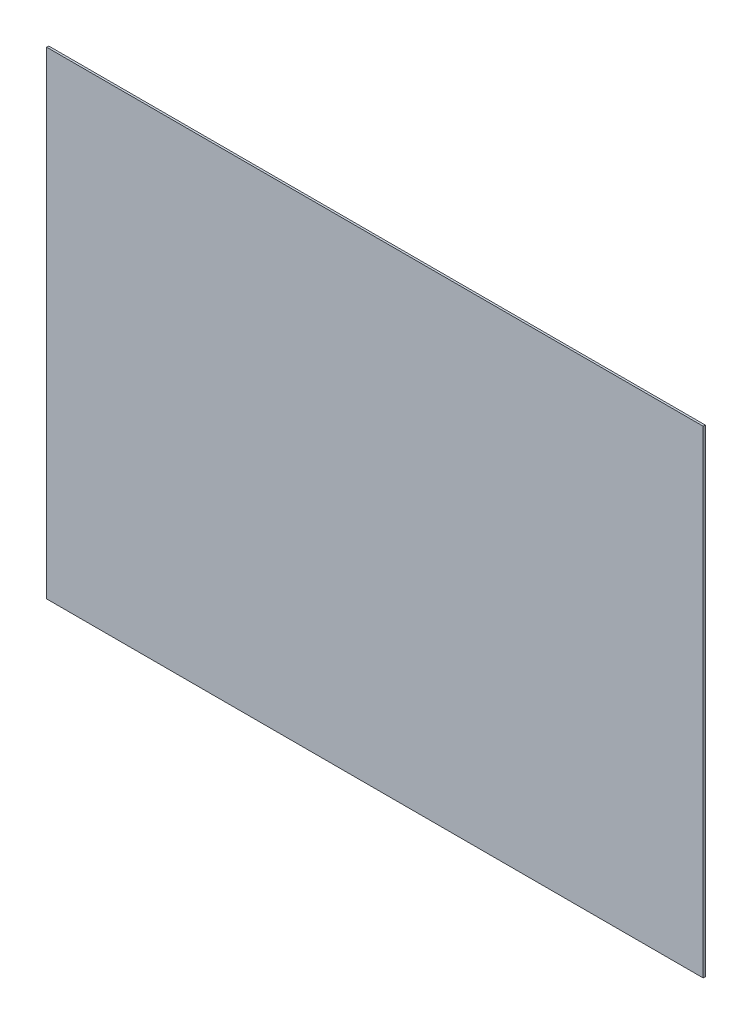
ISO-10303-21;
HEADER;
FILE_DESCRIPTION(('STEP AP214'),'2;1');
FILE_NAME('part.step','',(''),(''),'','','');
FILE_SCHEMA(('AUTOMOTIVE_DESIGN { 1 0 10303 214 1 1 1 1 }'));
ENDSEC;
DATA;
#1=APPLICATION_CONTEXT('core data for automotive mechanical design processes');
#2=APPLICATION_PROTOCOL_DEFINITION('international standard','automotive_design',2000,#1);
#3=PRODUCT_CONTEXT('',#1,'mechanical');
#4=PRODUCT('Part','Part','',(#3));
#5=PRODUCT_RELATED_PRODUCT_CATEGORY('part','',(#4));
#6=PRODUCT_DEFINITION_FORMATION('','',#4);
#7=PRODUCT_DEFINITION_CONTEXT('part definition',#1,'design');
#8=PRODUCT_DEFINITION('design','',#6,#7);
#9=PRODUCT_DEFINITION_SHAPE('','',#8);
#10=(LENGTH_UNIT() NAMED_UNIT(*) SI_UNIT(.MILLI.,.METRE.));
#11=(NAMED_UNIT(*) PLANE_ANGLE_UNIT() SI_UNIT($,.RADIAN.));
#12=(NAMED_UNIT(*) SI_UNIT($,.STERADIAN.) SOLID_ANGLE_UNIT());
#13=UNCERTAINTY_MEASURE_WITH_UNIT(LENGTH_MEASURE(1.E-05),#10,'distance_accuracy_value','');
#14=(GEOMETRIC_REPRESENTATION_CONTEXT(3) GLOBAL_UNCERTAINTY_ASSIGNED_CONTEXT((#13)) GLOBAL_UNIT_ASSIGNED_CONTEXT((#10,
#11,#12)) REPRESENTATION_CONTEXT('',''));
#15=CARTESIAN_POINT('',(0.,0.,0.));
#16=DIRECTION('',(0.,0.,1.));
#17=DIRECTION('',(1.,0.,0.));
#18=AXIS2_PLACEMENT_3D('',#15,#16,#17);
#19=CARTESIAN_POINT('',(1143.06357996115,247.149382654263,0.5));
#20=DIRECTION('',(0.,1.,0.));
#21=DIRECTION('',(0.,0.,1.));
#22=AXIS2_PLACEMENT_3D('',#19,#20,#21);
#23=PLANE('',#22);
#24=DIRECTION('',(1.,0.,0.));
#25=VECTOR('',#24,1.);
#26=CARTESIAN_POINT('',(1143.06357996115,247.149382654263,0.5));
#27=LINE('',#26,#25);
#28=CARTESIAN_POINT('',(1144.06357996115,247.149382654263,0.5));
#29=VERTEX_POINT('',#28);
#30=CARTESIAN_POINT('',(1302.0635799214,247.149382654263,0.5));
#31=VERTEX_POINT('',#30);
#32=EDGE_CURVE('E91',#29,#31,#27,.T.);
#33=ORIENTED_EDGE('',*,*,#32,.F.);
#34=DIRECTION('',(0.,0.,-1.));
#35=VECTOR('',#34,1.);
#36=CARTESIAN_POINT('',(1144.06357996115,247.149382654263,0.5));
#37=LINE('',#36,#35);
#38=CARTESIAN_POINT('',(1144.06357996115,247.149382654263,0.));
#39=VERTEX_POINT('',#38);
#40=EDGE_CURVE('E96',#29,#39,#37,.T.);
#41=ORIENTED_EDGE('',*,*,#40,.T.);
#42=DIRECTION('',(1.,0.,0.));
#43=VECTOR('',#42,1.);
#44=CARTESIAN_POINT('',(1143.06357996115,247.149382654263,0.));
#45=LINE('',#44,#43);
#46=CARTESIAN_POINT('',(1302.0635799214,247.149382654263,0.));
#47=VERTEX_POINT('',#46);
#48=EDGE_CURVE('E83',#39,#47,#45,.T.);
#49=ORIENTED_EDGE('',*,*,#48,.T.);
#50=DIRECTION('',(0.,0.,-1.));
#51=VECTOR('',#50,1.);
#52=CARTESIAN_POINT('',(1302.0635799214,247.149382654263,0.5));
#53=LINE('',#52,#51);
#54=EDGE_CURVE('E45',#31,#47,#53,.T.);
#55=ORIENTED_EDGE('',*,*,#54,.F.);
#56=EDGE_LOOP('',(#33,#41,#49,#55));
#57=FACE_BOUND('',#56,.T.);
#58=ADVANCED_FACE('F38',(#57),#23,.F.);
#59=CARTESIAN_POINT('',(1302.0635799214,247.149382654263,0.5));
#60=DIRECTION('',(-1.,0.,0.));
#61=DIRECTION('',(0.,0.,1.));
#62=AXIS2_PLACEMENT_3D('',#59,#60,#61);
#63=PLANE('',#62);
#64=DIRECTION('',(0.,1.,0.));
#65=VECTOR('',#64,1.);
#66=CARTESIAN_POINT('',(1302.0635799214,247.149382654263,0.));
#67=LINE('',#66,#65);
#68=CARTESIAN_POINT('',(1302.0635799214,362.149382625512,0.));
#69=VERTEX_POINT('',#68);
#70=EDGE_CURVE('E73',#47,#69,#67,.T.);
#71=ORIENTED_EDGE('',*,*,#70,.T.);
#72=DIRECTION('',(0.,0.,-1.));
#73=VECTOR('',#72,1.);
#74=CARTESIAN_POINT('',(1302.0635799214,362.149382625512,0.5));
#75=LINE('',#74,#73);
#76=CARTESIAN_POINT('',(1302.0635799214,362.149382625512,0.5));
#77=VERTEX_POINT('',#76);
#78=EDGE_CURVE('E76',#77,#69,#75,.T.);
#79=ORIENTED_EDGE('',*,*,#78,.F.);
#80=DIRECTION('',(0.,1.,0.));
#81=VECTOR('',#80,1.);
#82=CARTESIAN_POINT('',(1302.0635799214,247.149382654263,0.5));
#83=LINE('',#82,#81);
#84=EDGE_CURVE('E60',#31,#77,#83,.T.);
#85=ORIENTED_EDGE('',*,*,#84,.F.);
#86=ORIENTED_EDGE('',*,*,#54,.T.);
#87=EDGE_LOOP('',(#71,#79,#85,#86));
#88=FACE_BOUND('',#87,.T.);
#89=ADVANCED_FACE('F75',(#88),#63,.F.);
#90=CARTESIAN_POINT('',(1302.0635799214,362.149382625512,0.5));
#91=DIRECTION('',(0.,-1.,0.));
#92=DIRECTION('',(0.,0.,-1.));
#93=AXIS2_PLACEMENT_3D('',#90,#91,#92);
#94=PLANE('',#93);
#95=DIRECTION('',(-1.,0.,0.));
#96=VECTOR('',#95,1.);
#97=CARTESIAN_POINT('',(1302.0635799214,362.149382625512,0.));
#98=LINE('',#97,#96);
#99=CARTESIAN_POINT('',(1144.06357996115,362.149382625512,0.));
#100=VERTEX_POINT('',#99);
#101=EDGE_CURVE('E82',#69,#100,#98,.T.);
#102=ORIENTED_EDGE('',*,*,#101,.T.);
#103=DIRECTION('',(0.,0.,1.));
#104=VECTOR('',#103,1.);
#105=CARTESIAN_POINT('',(1144.06357996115,362.149382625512,0.5));
#106=LINE('',#105,#104);
#107=CARTESIAN_POINT('',(1144.06357996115,362.149382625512,0.5));
#108=VERTEX_POINT('',#107);
#109=EDGE_CURVE('E52',#100,#108,#106,.T.);
#110=ORIENTED_EDGE('',*,*,#109,.T.);
#111=DIRECTION('',(-1.,0.,0.));
#112=VECTOR('',#111,1.);
#113=CARTESIAN_POINT('',(1302.0635799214,362.149382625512,0.5));
#114=LINE('',#113,#112);
#115=EDGE_CURVE('E88',#77,#108,#114,.T.);
#116=ORIENTED_EDGE('',*,*,#115,.F.);
#117=ORIENTED_EDGE('',*,*,#78,.T.);
#118=EDGE_LOOP('',(#102,#110,#116,#117));
#119=FACE_BOUND('',#118,.T.);
#120=ADVANCED_FACE('F87',(#119),#94,.F.);
#121=CARTESIAN_POINT('',(0.,0.,0.5));
#122=DIRECTION('',(0.,0.,1.));
#123=DIRECTION('',(1.,0.,0.));
#124=AXIS2_PLACEMENT_3D('',#121,#122,#123);
#125=PLANE('',#124);
#126=DIRECTION('',(0.,1.,0.));
#127=VECTOR('',#126,1.);
#128=CARTESIAN_POINT('',(1144.06357996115,365.366922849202,0.5));
#129=LINE('',#128,#127);
#130=EDGE_CURVE('E102',#29,#108,#129,.T.);
#131=ORIENTED_EDGE('',*,*,#130,.F.);
#132=ORIENTED_EDGE('',*,*,#32,.T.);
#133=ORIENTED_EDGE('',*,*,#84,.T.);
#134=ORIENTED_EDGE('',*,*,#115,.T.);
#135=EDGE_LOOP('',(#131,#132,#133,#134));
#136=FACE_BOUND('',#135,.T.);
#137=ADVANCED_FACE('F110',(#136),#125,.T.);
#138=CARTESIAN_POINT('',(0.,0.,0.));
#139=DIRECTION('',(0.,0.,1.));
#140=DIRECTION('',(1.,0.,0.));
#141=AXIS2_PLACEMENT_3D('',#138,#139,#140);
#142=PLANE('',#141);
#143=ORIENTED_EDGE('',*,*,#48,.F.);
#144=DIRECTION('',(0.,1.,0.));
#145=VECTOR('',#144,1.);
#146=CARTESIAN_POINT('',(1144.06357996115,0.,0.));
#147=LINE('',#146,#145);
#148=EDGE_CURVE('E11',#39,#100,#147,.T.);
#149=ORIENTED_EDGE('',*,*,#148,.T.);
#150=ORIENTED_EDGE('',*,*,#101,.F.);
#151=ORIENTED_EDGE('',*,*,#70,.F.);
#152=EDGE_LOOP('',(#143,#149,#150,#151));
#153=FACE_BOUND('',#152,.T.);
#154=ADVANCED_FACE('F90',(#153),#142,.F.);
#155=CARTESIAN_POINT('',(1144.06357996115,365.366922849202,0.));
#156=DIRECTION('',(1.,0.,0.));
#157=DIRECTION('',(0.,0.,-1.));
#158=AXIS2_PLACEMENT_3D('',#155,#156,#157);
#159=PLANE('',#158);
#160=ORIENTED_EDGE('',*,*,#130,.T.);
#161=ORIENTED_EDGE('',*,*,#109,.F.);
#162=ORIENTED_EDGE('',*,*,#148,.F.);
#163=ORIENTED_EDGE('',*,*,#40,.F.);
#164=EDGE_LOOP('',(#160,#161,#162,#163));
#165=FACE_BOUND('',#164,.T.);
#166=ADVANCED_FACE('F106',(#165),#159,.F.);
#167=CLOSED_SHELL('',(#58,#89,#120,#137,#154,#166));
#168=MANIFOLD_SOLID_BREP('B2',#167);
#169=ADVANCED_BREP_SHAPE_REPRESENTATION('',(#18,#168),#14);
#170=SHAPE_DEFINITION_REPRESENTATION(#9,#169);
ENDSEC;
END-ISO-10303-21;
